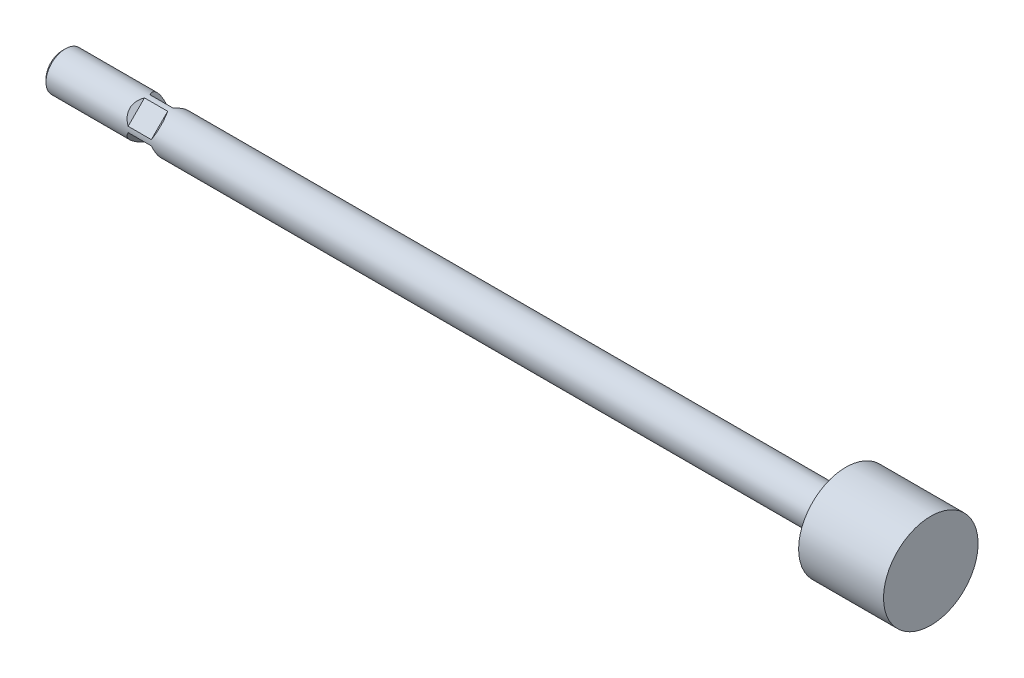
ISO-10303-21;
HEADER;
FILE_DESCRIPTION(('STEP AP214'),'2;1');
FILE_NAME('part.step','',(''),(''),'','','');
FILE_SCHEMA(('AUTOMOTIVE_DESIGN { 1 0 10303 214 1 1 1 1 }'));
ENDSEC;
DATA;
#1=APPLICATION_CONTEXT('core data for automotive mechanical design processes');
#2=APPLICATION_PROTOCOL_DEFINITION('international standard','automotive_design',2000,#1);
#3=PRODUCT_CONTEXT('',#1,'mechanical');
#4=PRODUCT('Part','Part','',(#3));
#5=PRODUCT_RELATED_PRODUCT_CATEGORY('part','',(#4));
#6=PRODUCT_DEFINITION_FORMATION('','',#4);
#7=PRODUCT_DEFINITION_CONTEXT('part definition',#1,'design');
#8=PRODUCT_DEFINITION('design','',#6,#7);
#9=PRODUCT_DEFINITION_SHAPE('','',#8);
#10=(LENGTH_UNIT() NAMED_UNIT(*) SI_UNIT(.MILLI.,.METRE.));
#11=(NAMED_UNIT(*) PLANE_ANGLE_UNIT() SI_UNIT($,.RADIAN.));
#12=(NAMED_UNIT(*) SI_UNIT($,.STERADIAN.) SOLID_ANGLE_UNIT());
#13=UNCERTAINTY_MEASURE_WITH_UNIT(LENGTH_MEASURE(1.E-05),#10,'distance_accuracy_value','');
#14=(GEOMETRIC_REPRESENTATION_CONTEXT(3) GLOBAL_UNCERTAINTY_ASSIGNED_CONTEXT((#13)) GLOBAL_UNIT_ASSIGNED_CONTEXT((#10,
#11,#12)) REPRESENTATION_CONTEXT('',''));
#15=CARTESIAN_POINT('',(0.,0.,0.));
#16=DIRECTION('',(0.,0.,1.));
#17=DIRECTION('',(1.,0.,0.));
#18=AXIS2_PLACEMENT_3D('',#15,#16,#17);
#19=CARTESIAN_POINT('',(192.,0.,0.));
#20=DIRECTION('',(-1.,0.,0.));
#21=DIRECTION('',(0.,0.,1.));
#22=AXIS2_PLACEMENT_3D('',#19,#20,#21);
#23=CYLINDRICAL_SURFACE('',#22,5.);
#24=DIRECTION('',(-1.,0.,0.));
#25=VECTOR('',#24,1.);
#26=CARTESIAN_POINT('',(192.,-0.707106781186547,4.94974746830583));
#27=LINE('',#26,#25);
#28=CARTESIAN_POINT('',(-11.,-0.707106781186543,4.94974746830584));
#29=VERTEX_POINT('',#28);
#30=CARTESIAN_POINT('',(-5.,-0.707106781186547,4.94974746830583));
#31=VERTEX_POINT('',#30);
#32=EDGE_CURVE('E104',#29,#31,#27,.F.);
#33=ORIENTED_EDGE('',*,*,#32,.T.);
#34=CARTESIAN_POINT('',(-9.,0.,0.));
#35=DIRECTION('',(0.707106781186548,0.5,-0.5));
#36=DIRECTION('',(-0.707106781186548,0.5,-0.5));
#37=AXIS2_PLACEMENT_3D('',#34,#35,#36);
#38=ELLIPSE('',#37,7.07106781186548,5.);
#39=CARTESIAN_POINT('',(-5.,-4.94974746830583,0.707106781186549));
#40=VERTEX_POINT('',#39);
#41=EDGE_CURVE('E11',#31,#40,#38,.T.);
#42=ORIENTED_EDGE('',*,*,#41,.T.);
#43=DIRECTION('',(-1.,0.,0.));
#44=VECTOR('',#43,1.);
#45=CARTESIAN_POINT('',(192.,-4.94974746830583,0.707106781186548));
#46=LINE('',#45,#44);
#47=CARTESIAN_POINT('',(-11.,-4.94974746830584,0.707106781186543));
#48=VERTEX_POINT('',#47);
#49=EDGE_CURVE('E23',#40,#48,#46,.T.);
#50=ORIENTED_EDGE('',*,*,#49,.T.);
#51=CARTESIAN_POINT('',(-7.,0.,0.));
#52=DIRECTION('',(-0.707106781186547,0.5,-0.5));
#53=DIRECTION('',(-0.707106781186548,-0.5,0.5));
#54=AXIS2_PLACEMENT_3D('',#51,#52,#53);
#55=ELLIPSE('',#54,7.07106781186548,5.);
#56=EDGE_CURVE('E101',#48,#29,#55,.T.);
#57=ORIENTED_EDGE('',*,*,#56,.T.);
#58=EDGE_LOOP('',(#33,#42,#50,#57));
#59=FACE_BOUND('',#58,.T.);
#60=DIRECTION('',(-1.,0.,0.));
#61=VECTOR('',#60,1.);
#62=CARTESIAN_POINT('',(192.,4.94974746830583,-0.707106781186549));
#63=LINE('',#62,#61);
#64=CARTESIAN_POINT('',(-5.,4.94974746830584,-0.707106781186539));
#65=VERTEX_POINT('',#64);
#66=CARTESIAN_POINT('',(-11.,4.94974746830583,-0.707106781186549));
#67=VERTEX_POINT('',#66);
#68=EDGE_CURVE('E90',#65,#67,#63,.T.);
#69=ORIENTED_EDGE('',*,*,#68,.T.);
#70=CARTESIAN_POINT('',(-7.,0.,0.));
#71=DIRECTION('',(-0.707106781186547,-0.5,0.5));
#72=DIRECTION('',(-0.707106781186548,0.5,-0.5));
#73=AXIS2_PLACEMENT_3D('',#70,#71,#72);
#74=ELLIPSE('',#73,7.07106781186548,5.);
#75=CARTESIAN_POINT('',(-11.,0.707106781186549,-4.94974746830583));
#76=VERTEX_POINT('',#75);
#77=EDGE_CURVE('E95',#67,#76,#74,.T.);
#78=ORIENTED_EDGE('',*,*,#77,.T.);
#79=DIRECTION('',(-1.,0.,0.));
#80=VECTOR('',#79,1.);
#81=CARTESIAN_POINT('',(192.,0.707106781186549,-4.94974746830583));
#82=LINE('',#81,#80);
#83=CARTESIAN_POINT('',(-5.,0.70710678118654,-4.94974746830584));
#84=VERTEX_POINT('',#83);
#85=EDGE_CURVE('E83',#76,#84,#82,.F.);
#86=ORIENTED_EDGE('',*,*,#85,.T.);
#87=CARTESIAN_POINT('',(-9.,0.,0.));
#88=DIRECTION('',(0.707106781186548,-0.5,0.5));
#89=DIRECTION('',(-0.707106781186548,-0.5,0.5));
#90=AXIS2_PLACEMENT_3D('',#87,#88,#89);
#91=ELLIPSE('',#90,7.07106781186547,5.);
#92=EDGE_CURVE('E78',#84,#65,#91,.T.);
#93=ORIENTED_EDGE('',*,*,#92,.T.);
#94=EDGE_LOOP('',(#69,#78,#86,#93));
#95=FACE_BOUND('',#94,.T.);
#96=DIRECTION('',(-1.,0.,0.));
#97=VECTOR('',#96,1.);
#98=CARTESIAN_POINT('',(192.,4.94974746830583,0.707106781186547));
#99=LINE('',#98,#97);
#100=CARTESIAN_POINT('',(-11.,4.94974746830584,0.707106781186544));
#101=VERTEX_POINT('',#100);
#102=CARTESIAN_POINT('',(-5.,4.94974746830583,0.707106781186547));
#103=VERTEX_POINT('',#102);
#104=EDGE_CURVE('E161',#101,#103,#99,.F.);
#105=ORIENTED_EDGE('',*,*,#104,.T.);
#106=CARTESIAN_POINT('',(-9.,0.,0.));
#107=DIRECTION('',(0.707106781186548,-0.5,-0.5));
#108=DIRECTION('',(-0.707106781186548,-0.5,-0.5));
#109=AXIS2_PLACEMENT_3D('',#106,#107,#108);
#110=ELLIPSE('',#109,7.07106781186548,5.);
#111=CARTESIAN_POINT('',(-5.,0.707106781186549,4.94974746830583));
#112=VERTEX_POINT('',#111);
#113=EDGE_CURVE('E84',#103,#112,#110,.T.);
#114=ORIENTED_EDGE('',*,*,#113,.T.);
#115=DIRECTION('',(-1.,0.,0.));
#116=VECTOR('',#115,1.);
#117=CARTESIAN_POINT('',(192.,0.707106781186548,4.94974746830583));
#118=LINE('',#117,#116);
#119=CARTESIAN_POINT('',(-11.,0.707106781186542,4.94974746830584));
#120=VERTEX_POINT('',#119);
#121=EDGE_CURVE('E164',#112,#120,#118,.T.);
#122=ORIENTED_EDGE('',*,*,#121,.T.);
#123=CARTESIAN_POINT('',(-7.,0.,0.));
#124=DIRECTION('',(-0.707106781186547,-0.5,-0.5));
#125=DIRECTION('',(-0.707106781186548,0.5,0.5));
#126=AXIS2_PLACEMENT_3D('',#123,#124,#125);
#127=ELLIPSE('',#126,7.07106781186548,5.);
#128=EDGE_CURVE('E158',#120,#101,#127,.T.);
#129=ORIENTED_EDGE('',*,*,#128,.T.);
#130=EDGE_LOOP('',(#105,#114,#122,#129));
#131=FACE_BOUND('',#130,.T.);
#132=DIRECTION('',(-1.,0.,0.));
#133=VECTOR('',#132,1.);
#134=CARTESIAN_POINT('',(192.,-0.707106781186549,-4.94974746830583));
#135=LINE('',#134,#133);
#136=CARTESIAN_POINT('',(-5.,-0.707106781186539,-4.94974746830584));
#137=VERTEX_POINT('',#136);
#138=CARTESIAN_POINT('',(-11.,-0.707106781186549,-4.94974746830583));
#139=VERTEX_POINT('',#138);
#140=EDGE_CURVE('E152',#137,#139,#135,.T.);
#141=ORIENTED_EDGE('',*,*,#140,.T.);
#142=CARTESIAN_POINT('',(-7.,0.,0.));
#143=DIRECTION('',(-0.707106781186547,0.5,0.5));
#144=DIRECTION('',(-0.707106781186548,-0.5,-0.5));
#145=AXIS2_PLACEMENT_3D('',#142,#143,#144);
#146=ELLIPSE('',#145,7.07106781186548,5.);
#147=CARTESIAN_POINT('',(-11.,-4.94974746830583,-0.707106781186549));
#148=VERTEX_POINT('',#147);
#149=EDGE_CURVE('E155',#139,#148,#146,.T.);
#150=ORIENTED_EDGE('',*,*,#149,.T.);
#151=DIRECTION('',(-1.,0.,0.));
#152=VECTOR('',#151,1.);
#153=CARTESIAN_POINT('',(192.,-4.94974746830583,-0.707106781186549));
#154=LINE('',#153,#152);
#155=CARTESIAN_POINT('',(-5.,-4.94974746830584,-0.707106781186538));
#156=VERTEX_POINT('',#155);
#157=EDGE_CURVE('E149',#148,#156,#154,.F.);
#158=ORIENTED_EDGE('',*,*,#157,.T.);
#159=CARTESIAN_POINT('',(-9.,0.,0.));
#160=DIRECTION('',(0.707106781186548,0.5,0.5));
#161=DIRECTION('',(-0.707106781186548,0.5,0.5));
#162=AXIS2_PLACEMENT_3D('',#159,#160,#161);
#163=ELLIPSE('',#162,7.07106781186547,5.);
#164=EDGE_CURVE('E146',#156,#137,#163,.T.);
#165=ORIENTED_EDGE('',*,*,#164,.T.);
#166=EDGE_LOOP('',(#141,#150,#158,#165));
#167=FACE_BOUND('',#166,.T.);
#168=CARTESIAN_POINT('',(170.,0.,0.));
#169=DIRECTION('',(-1.,0.,0.));
#170=DIRECTION('',(0.,0.,1.));
#171=AXIS2_PLACEMENT_3D('',#168,#169,#170);
#172=CIRCLE('',#171,5.);
#173=CARTESIAN_POINT('',(170.,0.,5.));
#174=VERTEX_POINT('',#173);
#175=EDGE_CURVE('E143',#174,#174,#172,.T.);
#176=ORIENTED_EDGE('',*,*,#175,.T.);
#177=EDGE_LOOP('',(#176));
#178=FACE_BOUND('',#177,.T.);
#179=CARTESIAN_POINT('',(-32.233,0.,0.));
#180=DIRECTION('',(-1.,0.,0.));
#181=DIRECTION('',(0.,0.,1.));
#182=AXIS2_PLACEMENT_3D('',#179,#180,#181);
#183=CIRCLE('',#182,5.);
#184=CARTESIAN_POINT('',(-32.233,0.,5.));
#185=VERTEX_POINT('',#184);
#186=EDGE_CURVE('E126',#185,#185,#183,.T.);
#187=ORIENTED_EDGE('',*,*,#186,.F.);
#188=EDGE_LOOP('',(#187));
#189=FACE_BOUND('',#188,.T.);
#190=ADVANCED_FACE('F16',(#59,#95,#131,#167,#178,#189),#23,.T.);
#191=CARTESIAN_POINT('',(170.,5.,0.));
#192=DIRECTION('',(1.,0.,0.));
#193=DIRECTION('',(0.,0.,-1.));
#194=AXIS2_PLACEMENT_3D('',#191,#192,#193);
#195=PLANE('',#194);
#196=ORIENTED_EDGE('',*,*,#175,.F.);
#197=EDGE_LOOP('',(#196));
#198=FACE_BOUND('',#197,.T.);
#199=CARTESIAN_POINT('',(170.,0.,0.));
#200=DIRECTION('',(-1.,0.,0.));
#201=DIRECTION('',(0.,0.,1.));
#202=AXIS2_PLACEMENT_3D('',#199,#200,#201);
#203=CIRCLE('',#202,12.25);
#204=CARTESIAN_POINT('',(170.,0.,12.25));
#205=VERTEX_POINT('',#204);
#206=EDGE_CURVE('E140',#205,#205,#203,.T.);
#207=ORIENTED_EDGE('',*,*,#206,.T.);
#208=EDGE_LOOP('',(#207));
#209=FACE_BOUND('',#208,.T.);
#210=ADVANCED_FACE('F188',(#198,#209),#195,.F.);
#211=CARTESIAN_POINT('',(192.,0.,0.));
#212=DIRECTION('',(-1.,0.,0.));
#213=DIRECTION('',(0.,0.,1.));
#214=AXIS2_PLACEMENT_3D('',#211,#212,#213);
#215=CYLINDRICAL_SURFACE('',#214,12.25);
#216=ORIENTED_EDGE('',*,*,#206,.F.);
#217=EDGE_LOOP('',(#216));
#218=FACE_BOUND('',#217,.T.);
#219=CARTESIAN_POINT('',(192.,0.,0.));
#220=DIRECTION('',(-1.,0.,0.));
#221=DIRECTION('',(0.,0.,1.));
#222=AXIS2_PLACEMENT_3D('',#219,#220,#221);
#223=CIRCLE('',#222,12.25);
#224=CARTESIAN_POINT('',(192.,0.,12.25));
#225=VERTEX_POINT('',#224);
#226=EDGE_CURVE('E137',#225,#225,#223,.T.);
#227=ORIENTED_EDGE('',*,*,#226,.T.);
#228=EDGE_LOOP('',(#227));
#229=FACE_BOUND('',#228,.T.);
#230=ADVANCED_FACE('F194',(#218,#229),#215,.T.);
#231=CARTESIAN_POINT('',(192.,12.25,0.));
#232=DIRECTION('',(-1.,0.,0.));
#233=DIRECTION('',(0.,0.,1.));
#234=AXIS2_PLACEMENT_3D('',#231,#232,#233);
#235=PLANE('',#234);
#236=ORIENTED_EDGE('',*,*,#226,.F.);
#237=EDGE_LOOP('',(#236));
#238=FACE_BOUND('',#237,.T.);
#239=ADVANCED_FACE('F200',(#238),#235,.F.);
#240=CARTESIAN_POINT('',(-33.,0.,0.));
#241=DIRECTION('',(1.,0.,0.));
#242=DIRECTION('',(0.,0.,-1.));
#243=AXIS2_PLACEMENT_3D('',#240,#241,#242);
#244=PLANE('',#243);
#245=CARTESIAN_POINT('',(-33.,0.,0.));
#246=DIRECTION('',(-1.,0.,0.));
#247=DIRECTION('',(0.,0.,1.));
#248=AXIS2_PLACEMENT_3D('',#245,#246,#247);
#249=CIRCLE('',#248,4.233);
#250=CARTESIAN_POINT('',(-33.,0.,4.233));
#251=VERTEX_POINT('',#250);
#252=EDGE_CURVE('E134',#251,#251,#249,.T.);
#253=ORIENTED_EDGE('',*,*,#252,.T.);
#254=EDGE_LOOP('',(#253));
#255=FACE_BOUND('',#254,.T.);
#256=ADVANCED_FACE('F208',(#255),#244,.F.);
#257=CARTESIAN_POINT('',(-32.233,0.,0.));
#258=DIRECTION('',(1.,0.,0.));
#259=DIRECTION('',(0.,0.,-1.));
#260=AXIS2_PLACEMENT_3D('',#257,#258,#259);
#261=CONICAL_SURFACE('',#260,5.,0.785398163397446);
#262=ORIENTED_EDGE('',*,*,#252,.F.);
#263=EDGE_LOOP('',(#262));
#264=FACE_BOUND('',#263,.T.);
#265=ORIENTED_EDGE('',*,*,#186,.T.);
#266=EDGE_LOOP('',(#265));
#267=FACE_BOUND('',#266,.T.);
#268=ADVANCED_FACE('F212',(#264,#267),#261,.T.);
#269=CARTESIAN_POINT('',(0.,0.707106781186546,-13.4350288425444));
#270=DIRECTION('',(0.707106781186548,0.5,0.5));
#271=DIRECTION('',(-0.577350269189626,0.816496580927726,0.));
#272=AXIS2_PLACEMENT_3D('',#269,#270,#271);
#273=PLANE('',#272);
#274=DIRECTION('',(0.,-0.707106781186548,0.707106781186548));
#275=VECTOR('',#274,1.);
#276=CARTESIAN_POINT('',(-5.,4.24264068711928,-9.89949493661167));
#277=LINE('',#276,#275);
#278=EDGE_CURVE('E115',#137,#156,#277,.T.);
#279=ORIENTED_EDGE('',*,*,#278,.F.);
#280=ORIENTED_EDGE('',*,*,#164,.F.);
#281=EDGE_LOOP('',(#279,#280));
#282=FACE_BOUND('',#281,.T.);
#283=ADVANCED_FACE('F216',(#282),#273,.F.);
#284=CARTESIAN_POINT('',(-5.,4.24264068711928,-9.89949493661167));
#285=DIRECTION('',(0.,0.707106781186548,0.707106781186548));
#286=DIRECTION('',(0.,-0.707106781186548,0.707106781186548));
#287=AXIS2_PLACEMENT_3D('',#284,#285,#286);
#288=PLANE('',#287);
#289=ORIENTED_EDGE('',*,*,#278,.T.);
#290=ORIENTED_EDGE('',*,*,#157,.F.);
#291=DIRECTION('',(0.,-0.707106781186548,0.707106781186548));
#292=VECTOR('',#291,1.);
#293=CARTESIAN_POINT('',(-11.,4.24264068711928,-9.89949493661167));
#294=LINE('',#293,#292);
#295=EDGE_CURVE('E118',#139,#148,#294,.T.);
#296=ORIENTED_EDGE('',*,*,#295,.F.);
#297=ORIENTED_EDGE('',*,*,#140,.F.);
#298=EDGE_LOOP('',(#289,#290,#296,#297));
#299=FACE_BOUND('',#298,.T.);
#300=ADVANCED_FACE('F220',(#299),#288,.F.);
#301=CARTESIAN_POINT('',(-11.,4.24264068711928,-9.89949493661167));
#302=DIRECTION('',(-0.707106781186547,0.5,0.5));
#303=DIRECTION('',(-0.577350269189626,-0.816496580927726,0.));
#304=AXIS2_PLACEMENT_3D('',#301,#302,#303);
#305=PLANE('',#304);
#306=ORIENTED_EDGE('',*,*,#295,.T.);
#307=ORIENTED_EDGE('',*,*,#149,.F.);
#308=EDGE_LOOP('',(#306,#307));
#309=FACE_BOUND('',#308,.T.);
#310=ADVANCED_FACE('F223',(#309),#305,.F.);
#311=CARTESIAN_POINT('',(-5.,9.89949493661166,-4.24264068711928));
#312=DIRECTION('',(0.707106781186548,-0.5,-0.5));
#313=DIRECTION('',(0.577350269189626,0.816496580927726,0.));
#314=AXIS2_PLACEMENT_3D('',#311,#312,#313);
#315=PLANE('',#314);
#316=DIRECTION('',(0.,-0.707106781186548,0.707106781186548));
#317=VECTOR('',#316,1.);
#318=CARTESIAN_POINT('',(-5.,9.89949493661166,-4.24264068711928));
#319=LINE('',#318,#317);
#320=EDGE_CURVE('E123',#103,#112,#319,.T.);
#321=ORIENTED_EDGE('',*,*,#320,.T.);
#322=ORIENTED_EDGE('',*,*,#113,.F.);
#323=EDGE_LOOP('',(#321,#322));
#324=FACE_BOUND('',#323,.T.);
#325=ADVANCED_FACE('F171',(#324),#315,.F.);
#326=CARTESIAN_POINT('',(-11.,9.89949493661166,-4.24264068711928));
#327=DIRECTION('',(0.,-0.707106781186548,-0.707106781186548));
#328=DIRECTION('',(0.,0.707106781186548,-0.707106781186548));
#329=AXIS2_PLACEMENT_3D('',#326,#327,#328);
#330=PLANE('',#329);
#331=ORIENTED_EDGE('',*,*,#320,.F.);
#332=ORIENTED_EDGE('',*,*,#104,.F.);
#333=DIRECTION('',(0.,-0.707106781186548,0.707106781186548));
#334=VECTOR('',#333,1.);
#335=CARTESIAN_POINT('',(-11.,9.89949493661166,-4.24264068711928));
#336=LINE('',#335,#334);
#337=EDGE_CURVE('E127',#101,#120,#336,.T.);
#338=ORIENTED_EDGE('',*,*,#337,.T.);
#339=ORIENTED_EDGE('',*,*,#121,.F.);
#340=EDGE_LOOP('',(#331,#332,#338,#339));
#341=FACE_BOUND('',#340,.T.);
#342=ADVANCED_FACE('F173',(#341),#330,.F.);
#343=CARTESIAN_POINT('',(-13.,11.3137084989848,-2.82842712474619));
#344=DIRECTION('',(-0.707106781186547,-0.5,-0.5));
#345=DIRECTION('',(0.577350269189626,-0.816496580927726,0.));
#346=AXIS2_PLACEMENT_3D('',#343,#344,#345);
#347=PLANE('',#346);
#348=ORIENTED_EDGE('',*,*,#337,.F.);
#349=ORIENTED_EDGE('',*,*,#128,.F.);
#350=EDGE_LOOP('',(#348,#349));
#351=FACE_BOUND('',#350,.T.);
#352=ADVANCED_FACE('F175',(#351),#347,.F.);
#353=CARTESIAN_POINT('',(0.,13.4350288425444,0.707106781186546));
#354=DIRECTION('',(0.707106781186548,-0.5,0.5));
#355=DIRECTION('',(0.577350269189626,0.,-0.816496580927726));
#356=AXIS2_PLACEMENT_3D('',#353,#354,#355);
#357=PLANE('',#356);
#358=DIRECTION('',(0.,-0.707106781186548,-0.707106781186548));
#359=VECTOR('',#358,1.);
#360=CARTESIAN_POINT('',(-5.,9.89949493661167,4.24264068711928));
#361=LINE('',#360,#359);
#362=EDGE_CURVE('E36',#65,#84,#361,.T.);
#363=ORIENTED_EDGE('',*,*,#362,.F.);
#364=ORIENTED_EDGE('',*,*,#92,.F.);
#365=EDGE_LOOP('',(#363,#364));
#366=FACE_BOUND('',#365,.T.);
#367=ADVANCED_FACE('F79',(#366),#357,.F.);
#368=CARTESIAN_POINT('',(-5.,9.89949493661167,4.24264068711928));
#369=DIRECTION('',(0.,-0.707106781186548,0.707106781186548));
#370=DIRECTION('',(0.,-0.707106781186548,-0.707106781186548));
#371=AXIS2_PLACEMENT_3D('',#368,#369,#370);
#372=PLANE('',#371);
#373=ORIENTED_EDGE('',*,*,#362,.T.);
#374=ORIENTED_EDGE('',*,*,#85,.F.);
#375=DIRECTION('',(0.,-0.707106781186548,-0.707106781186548));
#376=VECTOR('',#375,1.);
#377=CARTESIAN_POINT('',(-11.,9.89949493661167,4.24264068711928));
#378=LINE('',#377,#376);
#379=EDGE_CURVE('E91',#67,#76,#378,.T.);
#380=ORIENTED_EDGE('',*,*,#379,.F.);
#381=ORIENTED_EDGE('',*,*,#68,.F.);
#382=EDGE_LOOP('',(#373,#374,#380,#381));
#383=FACE_BOUND('',#382,.T.);
#384=ADVANCED_FACE('F87',(#383),#372,.F.);
#385=CARTESIAN_POINT('',(-11.,9.89949493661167,4.24264068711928));
#386=DIRECTION('',(-0.707106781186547,-0.5,0.5));
#387=DIRECTION('',(0.577350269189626,0.,0.816496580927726));
#388=AXIS2_PLACEMENT_3D('',#385,#386,#387);
#389=PLANE('',#388);
#390=ORIENTED_EDGE('',*,*,#379,.T.);
#391=ORIENTED_EDGE('',*,*,#77,.F.);
#392=EDGE_LOOP('',(#390,#391));
#393=FACE_BOUND('',#392,.T.);
#394=ADVANCED_FACE('F244',(#393),#389,.F.);
#395=CARTESIAN_POINT('',(-5.,4.24264068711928,9.89949493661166));
#396=DIRECTION('',(0.707106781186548,0.5,-0.5));
#397=DIRECTION('',(-0.577350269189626,0.,-0.816496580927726));
#398=AXIS2_PLACEMENT_3D('',#395,#396,#397);
#399=PLANE('',#398);
#400=DIRECTION('',(0.,-0.707106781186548,-0.707106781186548));
#401=VECTOR('',#400,1.);
#402=CARTESIAN_POINT('',(-5.,4.24264068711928,9.89949493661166));
#403=LINE('',#402,#401);
#404=EDGE_CURVE('E112',#31,#40,#403,.T.);
#405=ORIENTED_EDGE('',*,*,#404,.T.);
#406=ORIENTED_EDGE('',*,*,#41,.F.);
#407=EDGE_LOOP('',(#405,#406));
#408=FACE_BOUND('',#407,.T.);
#409=ADVANCED_FACE('F114',(#408),#399,.F.);
#410=CARTESIAN_POINT('',(-11.,4.24264068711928,9.89949493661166));
#411=DIRECTION('',(0.,0.707106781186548,-0.707106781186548));
#412=DIRECTION('',(0.,0.707106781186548,0.707106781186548));
#413=AXIS2_PLACEMENT_3D('',#410,#411,#412);
#414=PLANE('',#413);
#415=ORIENTED_EDGE('',*,*,#404,.F.);
#416=ORIENTED_EDGE('',*,*,#32,.F.);
#417=DIRECTION('',(0.,-0.707106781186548,-0.707106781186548));
#418=VECTOR('',#417,1.);
#419=CARTESIAN_POINT('',(-11.,4.24264068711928,9.89949493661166));
#420=LINE('',#419,#418);
#421=EDGE_CURVE('E29',#29,#48,#420,.T.);
#422=ORIENTED_EDGE('',*,*,#421,.T.);
#423=ORIENTED_EDGE('',*,*,#49,.F.);
#424=EDGE_LOOP('',(#415,#416,#422,#423));
#425=FACE_BOUND('',#424,.T.);
#426=ADVANCED_FACE('F111',(#425),#414,.F.);
#427=CARTESIAN_POINT('',(-13.,2.82842712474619,11.3137084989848));
#428=DIRECTION('',(-0.707106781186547,0.5,-0.5));
#429=DIRECTION('',(-0.577350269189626,0.,0.816496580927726));
#430=AXIS2_PLACEMENT_3D('',#427,#428,#429);
#431=PLANE('',#430);
#432=ORIENTED_EDGE('',*,*,#421,.F.);
#433=ORIENTED_EDGE('',*,*,#56,.F.);
#434=EDGE_LOOP('',(#432,#433));
#435=FACE_BOUND('',#434,.T.);
#436=ADVANCED_FACE('F248',(#435),#431,.F.);
#437=CLOSED_SHELL('',(#190,#210,#230,#239,#256,#268,#283,#300,#310,#325,#342,#352,#367,#384,
#394,#409,#426,#436));
#438=MANIFOLD_SOLID_BREP('B1',#437);
#439=ADVANCED_BREP_SHAPE_REPRESENTATION('',(#18,#438),#14);
#440=SHAPE_DEFINITION_REPRESENTATION(#9,#439);
ENDSEC;
END-ISO-10303-21;
